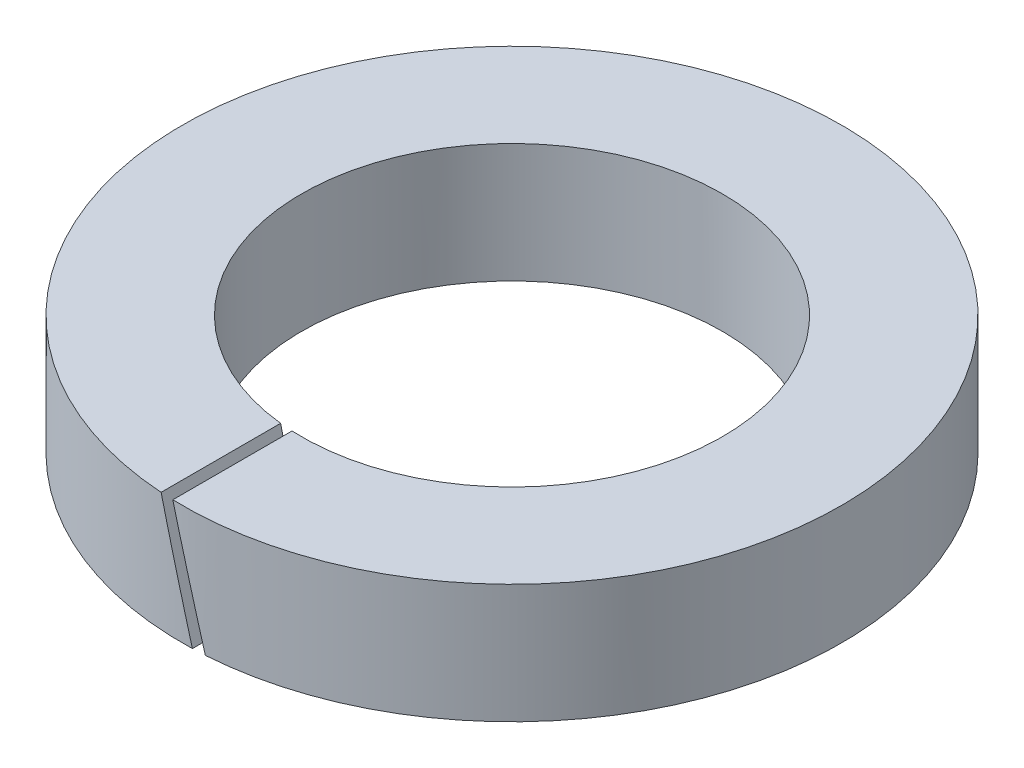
ISO-10303-21;
HEADER;
FILE_DESCRIPTION(('STEP AP214'),'2;1');
FILE_NAME('part.step','',(''),(''),'','','');
FILE_SCHEMA(('AUTOMOTIVE_DESIGN { 1 0 10303 214 1 1 1 1 }'));
ENDSEC;
DATA;
#1=APPLICATION_CONTEXT('core data for automotive mechanical design processes');
#2=APPLICATION_PROTOCOL_DEFINITION('international standard','automotive_design',2000,#1);
#3=PRODUCT_CONTEXT('',#1,'mechanical');
#4=PRODUCT('Part','Part','',(#3));
#5=PRODUCT_RELATED_PRODUCT_CATEGORY('part','',(#4));
#6=PRODUCT_DEFINITION_FORMATION('','',#4);
#7=PRODUCT_DEFINITION_CONTEXT('part definition',#1,'design');
#8=PRODUCT_DEFINITION('design','',#6,#7);
#9=PRODUCT_DEFINITION_SHAPE('','',#8);
#10=(LENGTH_UNIT() NAMED_UNIT(*) SI_UNIT(.MILLI.,.METRE.));
#11=(NAMED_UNIT(*) PLANE_ANGLE_UNIT() SI_UNIT($,.RADIAN.));
#12=(NAMED_UNIT(*) SI_UNIT($,.STERADIAN.) SOLID_ANGLE_UNIT());
#13=UNCERTAINTY_MEASURE_WITH_UNIT(LENGTH_MEASURE(1.E-05),#10,'distance_accuracy_value','');
#14=(GEOMETRIC_REPRESENTATION_CONTEXT(3) GLOBAL_UNCERTAINTY_ASSIGNED_CONTEXT((#13)) GLOBAL_UNIT_ASSIGNED_CONTEXT((#10,
#11,#12)) REPRESENTATION_CONTEXT('',''));
#15=CARTESIAN_POINT('',(0.,0.,0.));
#16=DIRECTION('',(0.,0.,1.));
#17=DIRECTION('',(1.,0.,0.));
#18=AXIS2_PLACEMENT_3D('',#15,#16,#17);
#19=CARTESIAN_POINT('',(0.,0.5,0.));
#20=DIRECTION('',(0.,1.,0.));
#21=DIRECTION('',(0.,0.,1.));
#22=AXIS2_PLACEMENT_3D('',#19,#20,#21);
#23=CYLINDRICAL_SURFACE('',#22,2.65);
#24=CARTESIAN_POINT('',(0.,1.03977774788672,0.));
#25=DIRECTION('',(-0.965925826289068,-0.258819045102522,0.));
#26=DIRECTION('',(-0.258819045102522,0.965925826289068,0.));
#27=AXIS2_PLACEMENT_3D('',#24,#25,#26);
#28=ELLIPSE('',#27,10.2388137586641,2.65);
#29=CARTESIAN_POINT('',(0.2786076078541,0.,2.63531360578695));
#30=VERTEX_POINT('',#29);
#31=CARTESIAN_POINT('',(-0.123316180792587,1.5,2.64712922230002));
#32=VERTEX_POINT('',#31);
#33=EDGE_CURVE('E47',#30,#32,#28,.T.);
#34=ORIENTED_EDGE('',*,*,#33,.T.);
#35=CARTESIAN_POINT('',(0.,1.5,0.));
#36=DIRECTION('',(0.,1.,0.));
#37=DIRECTION('',(0.,0.,1.));
#38=AXIS2_PLACEMENT_3D('',#35,#36,#37);
#39=CIRCLE('',#38,2.65);
#40=CARTESIAN_POINT('',(-0.2786076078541,1.5,2.63531360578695));
#41=VERTEX_POINT('',#40);
#42=EDGE_CURVE('E11',#32,#41,#39,.T.);
#43=ORIENTED_EDGE('',*,*,#42,.T.);
#44=CARTESIAN_POINT('',(0.,0.460222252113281,0.));
#45=DIRECTION('',(-0.965925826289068,-0.258819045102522,0.));
#46=DIRECTION('',(-0.258819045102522,0.965925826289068,0.));
#47=AXIS2_PLACEMENT_3D('',#44,#45,#46);
#48=ELLIPSE('',#47,10.2388137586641,2.65);
#49=CARTESIAN_POINT('',(0.123316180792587,0.,2.64712922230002));
#50=VERTEX_POINT('',#49);
#51=EDGE_CURVE('E96',#50,#41,#48,.T.);
#52=ORIENTED_EDGE('',*,*,#51,.F.);
#53=CARTESIAN_POINT('',(0.,0.,0.));
#54=DIRECTION('',(0.,1.,0.));
#55=DIRECTION('',(0.,0.,1.));
#56=AXIS2_PLACEMENT_3D('',#53,#54,#55);
#57=CIRCLE('',#56,2.65);
#58=EDGE_CURVE('E89',#30,#50,#57,.T.);
#59=ORIENTED_EDGE('',*,*,#58,.F.);
#60=EDGE_LOOP('',(#34,#43,#52,#59));
#61=FACE_BOUND('',#60,.T.);
#62=ADVANCED_FACE('F33',(#61),#23,.F.);
#63=CARTESIAN_POINT('',(2.65,1.5,0.));
#64=DIRECTION('',(0.,-1.,0.));
#65=DIRECTION('',(0.,0.,-1.));
#66=AXIS2_PLACEMENT_3D('',#63,#64,#65);
#67=PLANE('',#66);
#68=DIRECTION('',(0.,0.,1.));
#69=VECTOR('',#68,1.);
#70=CARTESIAN_POINT('',(-0.123316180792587,1.5,-4.151));
#71=LINE('',#70,#69);
#72=CARTESIAN_POINT('',(-0.123316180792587,1.5,4.1481674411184));
#73=VERTEX_POINT('',#72);
#74=EDGE_CURVE('E74',#32,#73,#71,.T.);
#75=ORIENTED_EDGE('',*,*,#74,.T.);
#76=CARTESIAN_POINT('',(0.,1.5,0.));
#77=DIRECTION('',(0.,1.,0.));
#78=DIRECTION('',(0.,0.,1.));
#79=AXIS2_PLACEMENT_3D('',#76,#77,#78);
#80=CIRCLE('',#79,4.15);
#81=CARTESIAN_POINT('',(-0.2786076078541,1.5,4.14063736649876));
#82=VERTEX_POINT('',#81);
#83=EDGE_CURVE('E40',#73,#82,#80,.T.);
#84=ORIENTED_EDGE('',*,*,#83,.T.);
#85=DIRECTION('',(0.,0.,1.));
#86=VECTOR('',#85,1.);
#87=CARTESIAN_POINT('',(-0.2786076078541,1.5,-4.151));
#88=LINE('',#87,#86);
#89=EDGE_CURVE('E98',#41,#82,#88,.T.);
#90=ORIENTED_EDGE('',*,*,#89,.F.);
#91=ORIENTED_EDGE('',*,*,#42,.F.);
#92=EDGE_LOOP('',(#75,#84,#90,#91));
#93=FACE_BOUND('',#92,.T.);
#94=ADVANCED_FACE('F84',(#93),#67,.F.);
#95=CARTESIAN_POINT('',(0.,0.5,0.));
#96=DIRECTION('',(0.,1.,0.));
#97=DIRECTION('',(0.,0.,1.));
#98=AXIS2_PLACEMENT_3D('',#95,#96,#97);
#99=CYLINDRICAL_SURFACE('',#98,4.15);
#100=CARTESIAN_POINT('',(0.,1.03977774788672,0.));
#101=DIRECTION('',(-0.965925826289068,-0.258819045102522,0.));
#102=DIRECTION('',(-0.258819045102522,0.965925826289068,0.));
#103=AXIS2_PLACEMENT_3D('',#100,#101,#102);
#104=ELLIPSE('',#103,16.0343687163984,4.15);
#105=CARTESIAN_POINT('',(0.2786076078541,0.,4.14063736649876));
#106=VERTEX_POINT('',#105);
#107=EDGE_CURVE('E71',#73,#106,#104,.F.);
#108=ORIENTED_EDGE('',*,*,#107,.T.);
#109=CARTESIAN_POINT('',(0.,0.,0.));
#110=DIRECTION('',(0.,1.,0.));
#111=DIRECTION('',(0.,0.,1.));
#112=AXIS2_PLACEMENT_3D('',#109,#110,#111);
#113=CIRCLE('',#112,4.15);
#114=CARTESIAN_POINT('',(0.123316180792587,0.,4.1481674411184));
#115=VERTEX_POINT('',#114);
#116=EDGE_CURVE('E88',#106,#115,#113,.T.);
#117=ORIENTED_EDGE('',*,*,#116,.T.);
#118=CARTESIAN_POINT('',(0.,0.460222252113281,0.));
#119=DIRECTION('',(-0.965925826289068,-0.258819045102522,0.));
#120=DIRECTION('',(-0.258819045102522,0.965925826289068,0.));
#121=AXIS2_PLACEMENT_3D('',#118,#119,#120);
#122=ELLIPSE('',#121,16.0343687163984,4.15);
#123=EDGE_CURVE('E55',#82,#115,#122,.F.);
#124=ORIENTED_EDGE('',*,*,#123,.F.);
#125=ORIENTED_EDGE('',*,*,#83,.F.);
#126=EDGE_LOOP('',(#108,#117,#124,#125));
#127=FACE_BOUND('',#126,.T.);
#128=ADVANCED_FACE('F87',(#127),#99,.T.);
#129=CARTESIAN_POINT('',(2.65,0.,0.));
#130=DIRECTION('',(0.,1.,0.));
#131=DIRECTION('',(0.,0.,1.));
#132=AXIS2_PLACEMENT_3D('',#129,#130,#131);
#133=PLANE('',#132);
#134=DIRECTION('',(0.,0.,-1.));
#135=VECTOR('',#134,1.);
#136=CARTESIAN_POINT('',(0.2786076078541,0.,-4.151));
#137=LINE('',#136,#135);
#138=EDGE_CURVE('E75',#106,#30,#137,.T.);
#139=ORIENTED_EDGE('',*,*,#138,.T.);
#140=ORIENTED_EDGE('',*,*,#58,.T.);
#141=DIRECTION('',(0.,0.,-1.));
#142=VECTOR('',#141,1.);
#143=CARTESIAN_POINT('',(0.123316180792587,0.,-4.151));
#144=LINE('',#143,#142);
#145=EDGE_CURVE('E100',#115,#50,#144,.T.);
#146=ORIENTED_EDGE('',*,*,#145,.F.);
#147=ORIENTED_EDGE('',*,*,#116,.F.);
#148=EDGE_LOOP('',(#139,#140,#146,#147));
#149=FACE_BOUND('',#148,.T.);
#150=ADVANCED_FACE('F107',(#149),#133,.F.);
#151=CARTESIAN_POINT('',(-0.0724444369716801,0.730588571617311,-4.151));
#152=DIRECTION('',(-0.965925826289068,-0.258819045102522,0.));
#153=DIRECTION('',(0.258819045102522,-0.965925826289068,0.));
#154=AXIS2_PLACEMENT_3D('',#151,#152,#153);
#155=PLANE('',#154);
#156=ORIENTED_EDGE('',*,*,#51,.T.);
#157=ORIENTED_EDGE('',*,*,#89,.T.);
#158=ORIENTED_EDGE('',*,*,#123,.T.);
#159=ORIENTED_EDGE('',*,*,#145,.T.);
#160=EDGE_LOOP('',(#156,#157,#158,#159));
#161=FACE_BOUND('',#160,.T.);
#162=ADVANCED_FACE('F103',(#161),#155,.F.);
#163=CARTESIAN_POINT('',(0.0724444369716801,0.769411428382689,-4.151));
#164=DIRECTION('',(-0.965925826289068,-0.258819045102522,0.));
#165=DIRECTION('',(0.258819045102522,-0.965925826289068,0.));
#166=AXIS2_PLACEMENT_3D('',#163,#164,#165);
#167=PLANE('',#166);
#168=ORIENTED_EDGE('',*,*,#138,.F.);
#169=ORIENTED_EDGE('',*,*,#107,.F.);
#170=ORIENTED_EDGE('',*,*,#74,.F.);
#171=ORIENTED_EDGE('',*,*,#33,.F.);
#172=EDGE_LOOP('',(#168,#169,#170,#171));
#173=FACE_BOUND('',#172,.T.);
#174=ADVANCED_FACE('F73',(#173),#167,.T.);
#175=CLOSED_SHELL('',(#62,#94,#128,#150,#162,#174));
#176=MANIFOLD_SOLID_BREP('B2',#175);
#177=ADVANCED_BREP_SHAPE_REPRESENTATION('',(#18,#176),#14);
#178=SHAPE_DEFINITION_REPRESENTATION(#9,#177);
ENDSEC;
END-ISO-10303-21;
